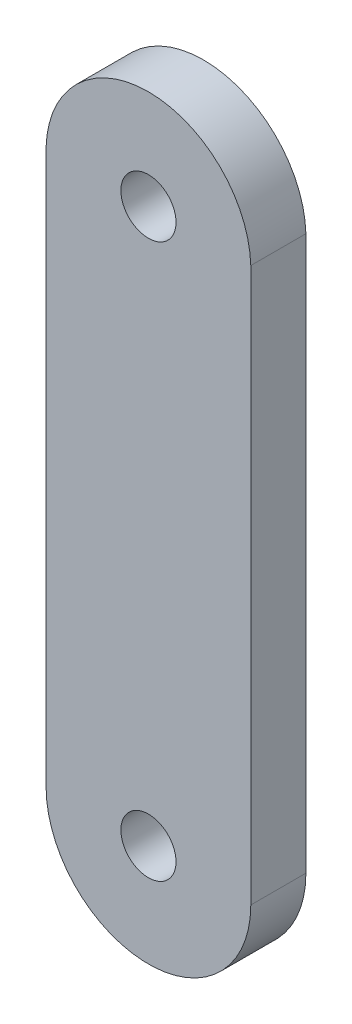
ISO-10303-21;
HEADER;
FILE_DESCRIPTION(('STEP AP214'),'2;1');
FILE_NAME('part.step','',(''),(''),'','','');
FILE_SCHEMA(('AUTOMOTIVE_DESIGN { 1 0 10303 214 1 1 1 1 }'));
ENDSEC;
DATA;
#1=APPLICATION_CONTEXT('core data for automotive mechanical design processes');
#2=APPLICATION_PROTOCOL_DEFINITION('international standard','automotive_design',2000,#1);
#3=PRODUCT_CONTEXT('',#1,'mechanical');
#4=PRODUCT('Part','Part','',(#3));
#5=PRODUCT_RELATED_PRODUCT_CATEGORY('part','',(#4));
#6=PRODUCT_DEFINITION_FORMATION('','',#4);
#7=PRODUCT_DEFINITION_CONTEXT('part definition',#1,'design');
#8=PRODUCT_DEFINITION('design','',#6,#7);
#9=PRODUCT_DEFINITION_SHAPE('','',#8);
#10=(LENGTH_UNIT() NAMED_UNIT(*) SI_UNIT(.MILLI.,.METRE.));
#11=(NAMED_UNIT(*) PLANE_ANGLE_UNIT() SI_UNIT($,.RADIAN.));
#12=(NAMED_UNIT(*) SI_UNIT($,.STERADIAN.) SOLID_ANGLE_UNIT());
#13=UNCERTAINTY_MEASURE_WITH_UNIT(LENGTH_MEASURE(1.E-05),#10,'distance_accuracy_value','');
#14=(GEOMETRIC_REPRESENTATION_CONTEXT(3) GLOBAL_UNCERTAINTY_ASSIGNED_CONTEXT((#13)) GLOBAL_UNIT_ASSIGNED_CONTEXT((#10,
#11,#12)) REPRESENTATION_CONTEXT('',''));
#15=CARTESIAN_POINT('',(0.,0.,0.));
#16=DIRECTION('',(0.,0.,1.));
#17=DIRECTION('',(1.,0.,0.));
#18=AXIS2_PLACEMENT_3D('',#15,#16,#17);
#19=CARTESIAN_POINT('',(0.0117888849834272,-88.0783372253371,10.));
#20=DIRECTION('',(0.,0.,-1.));
#21=DIRECTION('',(-1.,0.,0.));
#22=AXIS2_PLACEMENT_3D('',#19,#20,#21);
#23=CYLINDRICAL_SURFACE('',#22,5.00000000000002);
#24=CARTESIAN_POINT('',(0.0117888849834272,-88.0783372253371,0.));
#25=DIRECTION('',(0.,0.,1.));
#26=DIRECTION('',(1.,0.,0.));
#27=AXIS2_PLACEMENT_3D('',#24,#25,#26);
#28=CIRCLE('',#27,5.00000000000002);
#29=CARTESIAN_POINT('',(5.01178888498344,-88.0783372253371,0.));
#30=VERTEX_POINT('',#29);
#31=EDGE_CURVE('E84',#30,#30,#28,.T.);
#32=ORIENTED_EDGE('',*,*,#31,.F.);
#33=EDGE_LOOP('',(#32));
#34=FACE_BOUND('',#33,.T.);
#35=CARTESIAN_POINT('',(0.0117888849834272,-88.0783372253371,10.));
#36=DIRECTION('',(0.,0.,1.));
#37=DIRECTION('',(1.,0.,0.));
#38=AXIS2_PLACEMENT_3D('',#35,#36,#37);
#39=CIRCLE('',#38,5.00000000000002);
#40=CARTESIAN_POINT('',(5.01178888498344,-88.0783372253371,10.));
#41=VERTEX_POINT('',#40);
#42=EDGE_CURVE('E11',#41,#41,#39,.T.);
#43=ORIENTED_EDGE('',*,*,#42,.T.);
#44=EDGE_LOOP('',(#43));
#45=FACE_BOUND('',#44,.T.);
#46=ADVANCED_FACE('F16',(#34,#45),#23,.F.);
#47=CARTESIAN_POINT('',(0.0117888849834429,12.3771834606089,10.));
#48=DIRECTION('',(0.,0.,-1.));
#49=DIRECTION('',(-1.,0.,0.));
#50=AXIS2_PLACEMENT_3D('',#47,#48,#49);
#51=CYLINDRICAL_SURFACE('',#50,5.);
#52=CARTESIAN_POINT('',(0.0117888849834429,12.3771834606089,0.));
#53=DIRECTION('',(0.,0.,1.));
#54=DIRECTION('',(1.,0.,0.));
#55=AXIS2_PLACEMENT_3D('',#52,#53,#54);
#56=CIRCLE('',#55,5.);
#57=CARTESIAN_POINT('',(5.01178888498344,12.3771834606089,0.));
#58=VERTEX_POINT('',#57);
#59=EDGE_CURVE('E88',#58,#58,#56,.T.);
#60=ORIENTED_EDGE('',*,*,#59,.F.);
#61=EDGE_LOOP('',(#60));
#62=FACE_BOUND('',#61,.T.);
#63=CARTESIAN_POINT('',(0.0117888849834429,12.3771834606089,10.));
#64=DIRECTION('',(0.,0.,1.));
#65=DIRECTION('',(1.,0.,0.));
#66=AXIS2_PLACEMENT_3D('',#63,#64,#65);
#67=CIRCLE('',#66,5.);
#68=CARTESIAN_POINT('',(5.01178888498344,12.3771834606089,10.));
#69=VERTEX_POINT('',#68);
#70=EDGE_CURVE('E26',#69,#69,#67,.T.);
#71=ORIENTED_EDGE('',*,*,#70,.T.);
#72=EDGE_LOOP('',(#71));
#73=FACE_BOUND('',#72,.T.);
#74=ADVANCED_FACE('F102',(#62,#73),#51,.F.);
#75=CARTESIAN_POINT('',(0.0117888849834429,11.8187877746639,10.));
#76=DIRECTION('',(0.,0.,1.));
#77=DIRECTION('',(1.,0.,0.));
#78=AXIS2_PLACEMENT_3D('',#75,#76,#77);
#79=PLANE('',#78);
#80=ORIENTED_EDGE('',*,*,#70,.F.);
#81=EDGE_LOOP('',(#80));
#82=FACE_BOUND('',#81,.T.);
#83=CARTESIAN_POINT('',(0.0117888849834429,11.8187877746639,10.));
#84=DIRECTION('',(0.,0.,1.));
#85=DIRECTION('',(1.,0.,0.));
#86=AXIS2_PLACEMENT_3D('',#83,#84,#85);
#87=CIRCLE('',#86,18.575);
#88=CARTESIAN_POINT('',(18.5783938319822,12.3771834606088,10.));
#89=VERTEX_POINT('',#88);
#90=CARTESIAN_POINT('',(-18.5548160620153,12.3771834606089,10.));
#91=VERTEX_POINT('',#90);
#92=EDGE_CURVE('E91',#89,#91,#87,.T.);
#93=ORIENTED_EDGE('',*,*,#92,.T.);
#94=DIRECTION('',(0.,-1.,0.));
#95=VECTOR('',#94,1.);
#96=CARTESIAN_POINT('',(-18.5548160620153,12.3771834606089,10.));
#97=LINE('',#96,#95);
#98=CARTESIAN_POINT('',(-18.5548160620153,-88.0783372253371,10.));
#99=VERTEX_POINT('',#98);
#100=EDGE_CURVE('E35',#91,#99,#97,.T.);
#101=ORIENTED_EDGE('',*,*,#100,.T.);
#102=CARTESIAN_POINT('',(0.0117888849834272,-88.0783372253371,10.));
#103=DIRECTION('',(0.,0.,1.));
#104=DIRECTION('',(1.,0.,0.));
#105=AXIS2_PLACEMENT_3D('',#102,#103,#104);
#106=CIRCLE('',#105,18.5666049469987);
#107=CARTESIAN_POINT('',(18.5783938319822,-88.0783372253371,10.));
#108=VERTEX_POINT('',#107);
#109=EDGE_CURVE('E76',#99,#108,#106,.T.);
#110=ORIENTED_EDGE('',*,*,#109,.T.);
#111=DIRECTION('',(0.,1.,0.));
#112=VECTOR('',#111,1.);
#113=CARTESIAN_POINT('',(18.5783938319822,-88.0783372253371,10.));
#114=LINE('',#113,#112);
#115=EDGE_CURVE('E85',#108,#89,#114,.T.);
#116=ORIENTED_EDGE('',*,*,#115,.T.);
#117=EDGE_LOOP('',(#93,#101,#110,#116));
#118=FACE_BOUND('',#117,.T.);
#119=ORIENTED_EDGE('',*,*,#42,.F.);
#120=EDGE_LOOP('',(#119));
#121=FACE_BOUND('',#120,.T.);
#122=ADVANCED_FACE('F106',(#82,#118,#121),#79,.T.);
#123=CARTESIAN_POINT('',(0.0117888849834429,11.8187877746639,0.));
#124=DIRECTION('',(0.,0.,1.));
#125=DIRECTION('',(1.,0.,0.));
#126=AXIS2_PLACEMENT_3D('',#123,#124,#125);
#127=PLANE('',#126);
#128=ORIENTED_EDGE('',*,*,#59,.T.);
#129=EDGE_LOOP('',(#128));
#130=FACE_BOUND('',#129,.T.);
#131=CARTESIAN_POINT('',(0.0117888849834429,11.8187877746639,0.));
#132=DIRECTION('',(0.,0.,1.));
#133=DIRECTION('',(1.,0.,0.));
#134=AXIS2_PLACEMENT_3D('',#131,#132,#133);
#135=CIRCLE('',#134,18.575);
#136=CARTESIAN_POINT('',(18.5783938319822,12.3771834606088,0.));
#137=VERTEX_POINT('',#136);
#138=CARTESIAN_POINT('',(-18.5548160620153,12.3771834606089,0.));
#139=VERTEX_POINT('',#138);
#140=EDGE_CURVE('E81',#137,#139,#135,.T.);
#141=ORIENTED_EDGE('',*,*,#140,.F.);
#142=DIRECTION('',(0.,1.,0.));
#143=VECTOR('',#142,1.);
#144=CARTESIAN_POINT('',(18.5783938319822,-88.0783372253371,0.));
#145=LINE('',#144,#143);
#146=CARTESIAN_POINT('',(18.5783938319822,-88.0783372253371,0.));
#147=VERTEX_POINT('',#146);
#148=EDGE_CURVE('E55',#147,#137,#145,.T.);
#149=ORIENTED_EDGE('',*,*,#148,.F.);
#150=CARTESIAN_POINT('',(0.0117888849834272,-88.0783372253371,0.));
#151=DIRECTION('',(0.,0.,1.));
#152=DIRECTION('',(1.,0.,0.));
#153=AXIS2_PLACEMENT_3D('',#150,#151,#152);
#154=CIRCLE('',#153,18.5666049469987);
#155=CARTESIAN_POINT('',(-18.5548160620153,-88.0783372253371,0.));
#156=VERTEX_POINT('',#155);
#157=EDGE_CURVE('E57',#156,#147,#154,.T.);
#158=ORIENTED_EDGE('',*,*,#157,.F.);
#159=DIRECTION('',(0.,-1.,0.));
#160=VECTOR('',#159,1.);
#161=CARTESIAN_POINT('',(-18.5548160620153,12.3771834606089,0.));
#162=LINE('',#161,#160);
#163=EDGE_CURVE('E61',#139,#156,#162,.T.);
#164=ORIENTED_EDGE('',*,*,#163,.F.);
#165=EDGE_LOOP('',(#141,#149,#158,#164));
#166=FACE_BOUND('',#165,.T.);
#167=ORIENTED_EDGE('',*,*,#31,.T.);
#168=EDGE_LOOP('',(#167));
#169=FACE_BOUND('',#168,.T.);
#170=ADVANCED_FACE('F59',(#130,#166,#169),#127,.F.);
#171=CARTESIAN_POINT('',(0.0117888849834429,11.8187877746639,10.));
#172=DIRECTION('',(0.,0.,-1.));
#173=DIRECTION('',(-1.,0.,0.));
#174=AXIS2_PLACEMENT_3D('',#171,#172,#173);
#175=CYLINDRICAL_SURFACE('',#174,18.575);
#176=ORIENTED_EDGE('',*,*,#140,.T.);
#177=DIRECTION('',(0.,0.,-1.));
#178=VECTOR('',#177,1.);
#179=CARTESIAN_POINT('',(-18.5548160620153,12.3771834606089,10.));
#180=LINE('',#179,#178);
#181=EDGE_CURVE('E67',#91,#139,#180,.T.);
#182=ORIENTED_EDGE('',*,*,#181,.F.);
#183=ORIENTED_EDGE('',*,*,#92,.F.);
#184=DIRECTION('',(0.,0.,-1.));
#185=VECTOR('',#184,1.);
#186=CARTESIAN_POINT('',(18.5783938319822,12.3771834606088,10.));
#187=LINE('',#186,#185);
#188=EDGE_CURVE('E72',#89,#137,#187,.T.);
#189=ORIENTED_EDGE('',*,*,#188,.T.);
#190=EDGE_LOOP('',(#176,#182,#183,#189));
#191=FACE_BOUND('',#190,.T.);
#192=ADVANCED_FACE('F115',(#191),#175,.T.);
#193=CARTESIAN_POINT('',(-18.5548160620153,12.3771834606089,10.));
#194=DIRECTION('',(1.,0.,0.));
#195=DIRECTION('',(0.,1.,0.));
#196=AXIS2_PLACEMENT_3D('',#193,#194,#195);
#197=PLANE('',#196);
#198=ORIENTED_EDGE('',*,*,#163,.T.);
#199=DIRECTION('',(0.,0.,-1.));
#200=VECTOR('',#199,1.);
#201=CARTESIAN_POINT('',(-18.5548160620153,-88.0783372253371,10.));
#202=LINE('',#201,#200);
#203=EDGE_CURVE('E68',#99,#156,#202,.T.);
#204=ORIENTED_EDGE('',*,*,#203,.F.);
#205=ORIENTED_EDGE('',*,*,#100,.F.);
#206=ORIENTED_EDGE('',*,*,#181,.T.);
#207=EDGE_LOOP('',(#198,#204,#205,#206));
#208=FACE_BOUND('',#207,.T.);
#209=ADVANCED_FACE('F70',(#208),#197,.F.);
#210=CARTESIAN_POINT('',(0.0117888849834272,-88.0783372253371,10.));
#211=DIRECTION('',(0.,0.,-1.));
#212=DIRECTION('',(-1.,0.,0.));
#213=AXIS2_PLACEMENT_3D('',#210,#211,#212);
#214=CYLINDRICAL_SURFACE('',#213,18.5666049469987);
#215=ORIENTED_EDGE('',*,*,#157,.T.);
#216=DIRECTION('',(0.,0.,-1.));
#217=VECTOR('',#216,1.);
#218=CARTESIAN_POINT('',(18.5783938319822,-88.0783372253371,10.));
#219=LINE('',#218,#217);
#220=EDGE_CURVE('E20',#108,#147,#219,.T.);
#221=ORIENTED_EDGE('',*,*,#220,.F.);
#222=ORIENTED_EDGE('',*,*,#109,.F.);
#223=ORIENTED_EDGE('',*,*,#203,.T.);
#224=EDGE_LOOP('',(#215,#221,#222,#223));
#225=FACE_BOUND('',#224,.T.);
#226=ADVANCED_FACE('F74',(#225),#214,.T.);
#227=CARTESIAN_POINT('',(18.5783938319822,-88.0783372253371,10.));
#228=DIRECTION('',(-1.,0.,0.));
#229=DIRECTION('',(0.,-1.,0.));
#230=AXIS2_PLACEMENT_3D('',#227,#228,#229);
#231=PLANE('',#230);
#232=ORIENTED_EDGE('',*,*,#148,.T.);
#233=ORIENTED_EDGE('',*,*,#188,.F.);
#234=ORIENTED_EDGE('',*,*,#115,.F.);
#235=ORIENTED_EDGE('',*,*,#220,.T.);
#236=EDGE_LOOP('',(#232,#233,#234,#235));
#237=FACE_BOUND('',#236,.T.);
#238=ADVANCED_FACE('F18',(#237),#231,.F.);
#239=CLOSED_SHELL('',(#46,#74,#122,#170,#192,#209,#226,#238));
#240=MANIFOLD_SOLID_BREP('B1',#239);
#241=ADVANCED_BREP_SHAPE_REPRESENTATION('',(#18,#240),#14);
#242=SHAPE_DEFINITION_REPRESENTATION(#9,#241);
ENDSEC;
END-ISO-10303-21;
